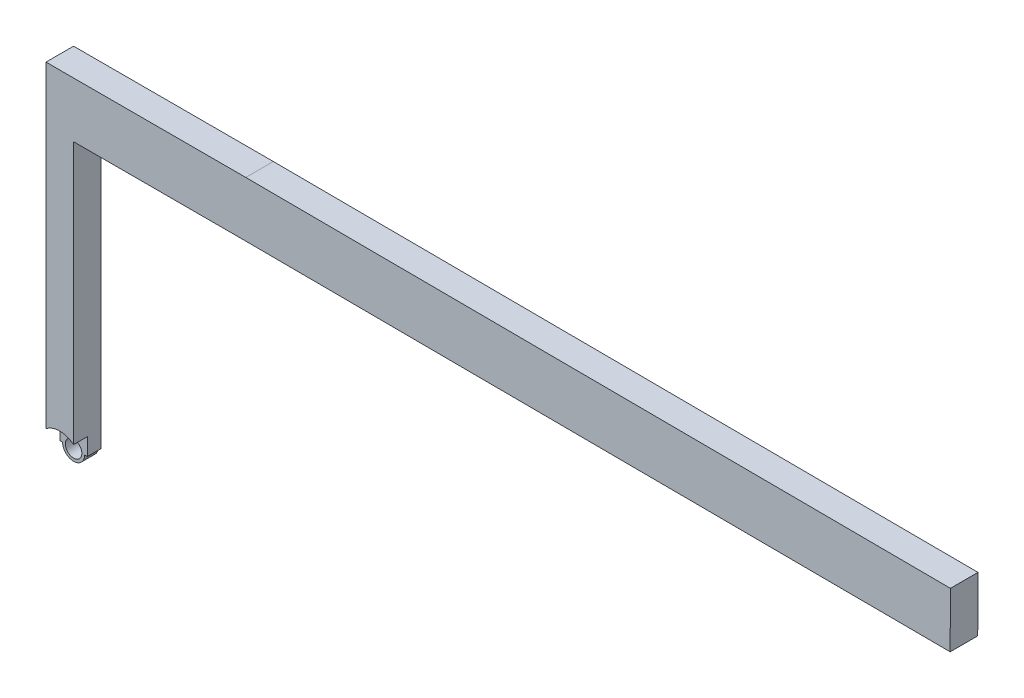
ISO-10303-21;
HEADER;
FILE_DESCRIPTION(('STEP AP214'),'2;1');
FILE_NAME('part.step','',(''),(''),'','','');
FILE_SCHEMA(('AUTOMOTIVE_DESIGN { 1 0 10303 214 1 1 1 1 }'));
ENDSEC;
DATA;
#1=APPLICATION_CONTEXT('core data for automotive mechanical design processes');
#2=APPLICATION_PROTOCOL_DEFINITION('international standard','automotive_design',2000,#1);
#3=PRODUCT_CONTEXT('',#1,'mechanical');
#4=PRODUCT('Part','Part','',(#3));
#5=PRODUCT_RELATED_PRODUCT_CATEGORY('part','',(#4));
#6=PRODUCT_DEFINITION_FORMATION('','',#4);
#7=PRODUCT_DEFINITION_CONTEXT('part definition',#1,'design');
#8=PRODUCT_DEFINITION('design','',#6,#7);
#9=PRODUCT_DEFINITION_SHAPE('','',#8);
#10=(LENGTH_UNIT() NAMED_UNIT(*) SI_UNIT(.MILLI.,.METRE.));
#11=(NAMED_UNIT(*) PLANE_ANGLE_UNIT() SI_UNIT($,.RADIAN.));
#12=(NAMED_UNIT(*) SI_UNIT($,.STERADIAN.) SOLID_ANGLE_UNIT());
#13=UNCERTAINTY_MEASURE_WITH_UNIT(LENGTH_MEASURE(1.E-05),#10,'distance_accuracy_value','');
#14=(GEOMETRIC_REPRESENTATION_CONTEXT(3) GLOBAL_UNCERTAINTY_ASSIGNED_CONTEXT((#13)) GLOBAL_UNIT_ASSIGNED_CONTEXT((#10,
#11,#12)) REPRESENTATION_CONTEXT('',''));
#15=CARTESIAN_POINT('',(0.,0.,0.));
#16=DIRECTION('',(0.,0.,1.));
#17=DIRECTION('',(1.,0.,0.));
#18=AXIS2_PLACEMENT_3D('',#15,#16,#17);
#19=CARTESIAN_POINT('',(24.1459547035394,13.3012355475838,1.27));
#20=DIRECTION('',(0.,0.,1.));
#21=DIRECTION('',(1.,0.,0.));
#22=AXIS2_PLACEMENT_3D('',#19,#20,#21);
#23=PLANE('',#22);
#24=CARTESIAN_POINT('',(-0.635,0.508,1.27));
#25=DIRECTION('',(0.,0.,1.));
#26=DIRECTION('',(1.,0.,0.));
#27=AXIS2_PLACEMENT_3D('',#24,#25,#26);
#28=CIRCLE('',#27,1.016);
#29=CARTESIAN_POINT('',(0.,1.3011147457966,1.27));
#30=VERTEX_POINT('',#29);
#31=CARTESIAN_POINT('',(-1.27,1.3011147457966,1.27));
#32=VERTEX_POINT('',#31);
#33=EDGE_CURVE('E148',#30,#32,#28,.T.);
#34=ORIENTED_EDGE('',*,*,#33,.F.);
#35=DIRECTION('',(0.,1.,0.));
#36=VECTOR('',#35,1.);
#37=CARTESIAN_POINT('',(0.,0.,1.27));
#38=LINE('',#37,#36);
#39=CARTESIAN_POINT('',(0.,13.382114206,1.27));
#40=VERTEX_POINT('',#39);
#41=EDGE_CURVE('E191',#30,#40,#38,.T.);
#42=ORIENTED_EDGE('',*,*,#41,.T.);
#43=DIRECTION('',(1.,0.,0.));
#44=VECTOR('',#43,1.);
#45=CARTESIAN_POINT('',(0.,13.382114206,1.27));
#46=LINE('',#45,#44);
#47=CARTESIAN_POINT('',(7.92442540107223,13.382114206,1.27));
#48=VERTEX_POINT('',#47);
#49=EDGE_CURVE('E193',#40,#48,#46,.T.);
#50=ORIENTED_EDGE('',*,*,#49,.T.);
#51=CARTESIAN_POINT('',(7.92442540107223,13.382114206,1.27));
#52=CARTESIAN_POINT('',(18.7387782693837,13.3281951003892,1.27));
#53=CARTESIAN_POINT('',(29.5531311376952,13.2742759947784,1.27));
#54=CARTESIAN_POINT('',(40.3674840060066,13.2203568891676,1.27));
#55=B_SPLINE_CURVE_WITH_KNOTS('',3,(#51,#52,#53,#54),.UNSPECIFIED.,.F.,.F.,(4,4),(0.,1.),.UNSPECIFIED.);
#56=CARTESIAN_POINT('',(40.3674840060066,13.2203568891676,1.27));
#57=VERTEX_POINT('',#56);
#58=EDGE_CURVE('E170',#48,#57,#55,.T.);
#59=ORIENTED_EDGE('',*,*,#58,.T.);
#60=DIRECTION('',(-0.00498582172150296,-0.999987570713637,0.));
#61=VECTOR('',#60,1.);
#62=CARTESIAN_POINT('',(40.3801479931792,15.7603253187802,1.27));
#63=LINE('',#62,#61);
#64=CARTESIAN_POINT('',(40.3801479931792,15.7603253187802,1.27));
#65=VERTEX_POINT('',#64);
#66=EDGE_CURVE('E174',#65,#57,#63,.T.);
#67=ORIENTED_EDGE('',*,*,#66,.F.);
#68=CARTESIAN_POINT('',(7.93075743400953,15.922114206,1.27));
#69=CARTESIAN_POINT('',(40.3801479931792,15.7603253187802,1.27));
#70=B_SPLINE_CURVE_WITH_KNOTS('',1,(#68,#69),.UNSPECIFIED.,.F.,.F.,(2,2),(0.,1.),.UNSPECIFIED.);
#71=CARTESIAN_POINT('',(7.93075743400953,15.922114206,1.27));
#72=VERTEX_POINT('',#71);
#73=EDGE_CURVE('E181',#72,#65,#70,.T.);
#74=ORIENTED_EDGE('',*,*,#73,.F.);
#75=DIRECTION('',(1.,0.,0.));
#76=VECTOR('',#75,1.);
#77=CARTESIAN_POINT('',(0.,15.922114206,1.27));
#78=LINE('',#77,#76);
#79=CARTESIAN_POINT('',(-1.27,15.922114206,1.27));
#80=VERTEX_POINT('',#79);
#81=EDGE_CURVE('E186',#80,#72,#78,.T.);
#82=ORIENTED_EDGE('',*,*,#81,.F.);
#83=DIRECTION('',(0.,-1.,0.));
#84=VECTOR('',#83,1.);
#85=CARTESIAN_POINT('',(-1.27,13.3012355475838,1.27));
#86=LINE('',#85,#84);
#87=EDGE_CURVE('E166',#80,#32,#86,.T.);
#88=ORIENTED_EDGE('',*,*,#87,.T.);
#89=EDGE_LOOP('',(#34,#42,#50,#59,#67,#74,#82,#88));
#90=FACE_BOUND('',#89,.T.);
#91=ADVANCED_FACE('F31',(#90),#23,.T.);
#92=CARTESIAN_POINT('',(0.,0.,1.27));
#93=DIRECTION('',(-1.,0.,0.));
#94=DIRECTION('',(0.,-1.,0.));
#95=AXIS2_PLACEMENT_3D('',#92,#93,#94);
#96=PLANE('',#95);
#97=DIRECTION('',(0.,1.,0.));
#98=VECTOR('',#97,1.);
#99=CARTESIAN_POINT('',(0.,0.,0.635));
#100=LINE('',#99,#98);
#101=CARTESIAN_POINT('',(0.,0.508,0.635));
#102=VERTEX_POINT('',#101);
#103=CARTESIAN_POINT('',(0.,1.3011147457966,0.635));
#104=VERTEX_POINT('',#103);
#105=EDGE_CURVE('E156',#102,#104,#100,.T.);
#106=ORIENTED_EDGE('',*,*,#105,.F.);
#107=DIRECTION('',(0.,0.,-1.));
#108=VECTOR('',#107,1.);
#109=CARTESIAN_POINT('',(0.,0.508,56.3948288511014));
#110=LINE('',#109,#108);
#111=CARTESIAN_POINT('',(0.,0.508,0.));
#112=VERTEX_POINT('',#111);
#113=EDGE_CURVE('E131',#102,#112,#110,.T.);
#114=ORIENTED_EDGE('',*,*,#113,.T.);
#115=DIRECTION('',(0.,1.,0.));
#116=VECTOR('',#115,1.);
#117=CARTESIAN_POINT('',(0.,0.,0.));
#118=LINE('',#117,#116);
#119=CARTESIAN_POINT('',(0.,13.382114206,0.));
#120=VERTEX_POINT('',#119);
#121=EDGE_CURVE('E216',#112,#120,#118,.T.);
#122=ORIENTED_EDGE('',*,*,#121,.T.);
#123=DIRECTION('',(0.,0.,-1.));
#124=VECTOR('',#123,1.);
#125=CARTESIAN_POINT('',(0.,13.382114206,1.27));
#126=LINE('',#125,#124);
#127=EDGE_CURVE('E221',#40,#120,#126,.T.);
#128=ORIENTED_EDGE('',*,*,#127,.F.);
#129=ORIENTED_EDGE('',*,*,#41,.F.);
#130=DIRECTION('',(0.,0.,1.));
#131=VECTOR('',#130,1.);
#132=CARTESIAN_POINT('',(0.,1.3011147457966,-2.23868195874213));
#133=LINE('',#132,#131);
#134=EDGE_CURVE('E153',#30,#104,#133,.F.);
#135=ORIENTED_EDGE('',*,*,#134,.T.);
#136=EDGE_LOOP('',(#106,#114,#122,#128,#129,#135));
#137=FACE_BOUND('',#136,.T.);
#138=ADVANCED_FACE('F246',(#137),#96,.F.);
#139=CARTESIAN_POINT('',(-1.27,0.,60.1023923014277));
#140=DIRECTION('',(-1.,0.,0.));
#141=DIRECTION('',(0.,0.,1.));
#142=AXIS2_PLACEMENT_3D('',#139,#140,#141);
#143=PLANE('',#142);
#144=DIRECTION('',(0.,0.,-1.));
#145=VECTOR('',#144,1.);
#146=CARTESIAN_POINT('',(-1.27,0.508,56.3948288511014));
#147=LINE('',#146,#145);
#148=CARTESIAN_POINT('',(-1.27,0.508,0.634999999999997));
#149=VERTEX_POINT('',#148);
#150=CARTESIAN_POINT('',(-1.27,0.508,0.));
#151=VERTEX_POINT('',#150);
#152=EDGE_CURVE('E139',#149,#151,#147,.T.);
#153=ORIENTED_EDGE('',*,*,#152,.F.);
#154=DIRECTION('',(0.,1.,0.));
#155=VECTOR('',#154,1.);
#156=CARTESIAN_POINT('',(-1.27,0.,0.634999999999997));
#157=LINE('',#156,#155);
#158=CARTESIAN_POINT('',(-1.27,1.3011147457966,0.635));
#159=VERTEX_POINT('',#158);
#160=EDGE_CURVE('E158',#149,#159,#157,.T.);
#161=ORIENTED_EDGE('',*,*,#160,.T.);
#162=DIRECTION('',(0.,0.,1.));
#163=VECTOR('',#162,1.);
#164=CARTESIAN_POINT('',(-1.27,1.3011147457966,-2.23868195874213));
#165=LINE('',#164,#163);
#166=EDGE_CURVE('E132',#32,#159,#165,.F.);
#167=ORIENTED_EDGE('',*,*,#166,.F.);
#168=ORIENTED_EDGE('',*,*,#87,.F.);
#169=DIRECTION('',(0.,0.,-1.));
#170=VECTOR('',#169,1.);
#171=CARTESIAN_POINT('',(-1.27,15.922114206,60.1023923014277));
#172=LINE('',#171,#170);
#173=CARTESIAN_POINT('',(-1.27,15.922114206,0.));
#174=VERTEX_POINT('',#173);
#175=EDGE_CURVE('E163',#80,#174,#172,.T.);
#176=ORIENTED_EDGE('',*,*,#175,.T.);
#177=DIRECTION('',(0.,-1.,0.));
#178=VECTOR('',#177,1.);
#179=CARTESIAN_POINT('',(-1.27,13.3012355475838,0.));
#180=LINE('',#179,#178);
#181=EDGE_CURVE('E231',#174,#151,#180,.T.);
#182=ORIENTED_EDGE('',*,*,#181,.T.);
#183=EDGE_LOOP('',(#153,#161,#167,#168,#176,#182));
#184=FACE_BOUND('',#183,.T.);
#185=ADVANCED_FACE('F253',(#184),#143,.T.);
#186=CARTESIAN_POINT('',(-0.635,0.508,0.));
#187=DIRECTION('',(0.,0.,1.));
#188=DIRECTION('',(1.,0.,0.));
#189=AXIS2_PLACEMENT_3D('',#186,#187,#188);
#190=CYLINDRICAL_SURFACE('',#189,0.381);
#191=CARTESIAN_POINT('',(-0.635,0.508,0.));
#192=DIRECTION('',(0.,0.,1.));
#193=DIRECTION('',(1.,0.,0.));
#194=AXIS2_PLACEMENT_3D('',#191,#192,#193);
#195=CIRCLE('',#194,0.381);
#196=CARTESIAN_POINT('',(-0.254,0.508,0.));
#197=VERTEX_POINT('',#196);
#198=EDGE_CURVE('E160',#197,#197,#195,.T.);
#199=ORIENTED_EDGE('',*,*,#198,.F.);
#200=EDGE_LOOP('',(#199));
#201=FACE_BOUND('',#200,.T.);
#202=CARTESIAN_POINT('',(-0.635,0.508,0.635));
#203=DIRECTION('',(0.,0.,1.));
#204=DIRECTION('',(1.,0.,0.));
#205=AXIS2_PLACEMENT_3D('',#202,#203,#204);
#206=CIRCLE('',#205,0.381);
#207=CARTESIAN_POINT('',(-0.254,0.508,0.635));
#208=VERTEX_POINT('',#207);
#209=EDGE_CURVE('E234',#208,#208,#206,.F.);
#210=ORIENTED_EDGE('',*,*,#209,.F.);
#211=EDGE_LOOP('',(#210));
#212=FACE_BOUND('',#211,.T.);
#213=ADVANCED_FACE('F289',(#201,#212),#190,.F.);
#214=CARTESIAN_POINT('',(0.,15.922114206,1.27));
#215=DIRECTION('',(0.,1.,0.));
#216=DIRECTION('',(0.,0.,1.));
#217=AXIS2_PLACEMENT_3D('',#214,#215,#216);
#218=PLANE('',#217);
#219=DIRECTION('',(1.,0.,0.));
#220=VECTOR('',#219,1.);
#221=CARTESIAN_POINT('',(0.,15.922114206,0.));
#222=LINE('',#221,#220);
#223=CARTESIAN_POINT('',(7.93075743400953,15.922114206,0.));
#224=VERTEX_POINT('',#223);
#225=EDGE_CURVE('E211',#174,#224,#222,.T.);
#226=ORIENTED_EDGE('',*,*,#225,.F.);
#227=ORIENTED_EDGE('',*,*,#175,.F.);
#228=ORIENTED_EDGE('',*,*,#81,.T.);
#229=DIRECTION('',(0.,0.,-1.));
#230=VECTOR('',#229,1.);
#231=CARTESIAN_POINT('',(7.93075743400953,15.922114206,1.27));
#232=LINE('',#231,#230);
#233=EDGE_CURVE('E224',#72,#224,#232,.T.);
#234=ORIENTED_EDGE('',*,*,#233,.T.);
#235=EDGE_LOOP('',(#226,#227,#228,#234));
#236=FACE_BOUND('',#235,.T.);
#237=ADVANCED_FACE('F256',(#236),#218,.T.);
#238=CARTESIAN_POINT('',(24.1459547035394,13.3012355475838,0.));
#239=DIRECTION('',(0.,0.,1.));
#240=DIRECTION('',(1.,0.,0.));
#241=AXIS2_PLACEMENT_3D('',#238,#239,#240);
#242=PLANE('',#241);
#243=ORIENTED_EDGE('',*,*,#198,.T.);
#244=EDGE_LOOP('',(#243));
#245=FACE_BOUND('',#244,.T.);
#246=CARTESIAN_POINT('',(-0.635,0.508,0.));
#247=DIRECTION('',(0.,0.,1.));
#248=DIRECTION('',(1.,0.,0.));
#249=AXIS2_PLACEMENT_3D('',#246,#247,#248);
#250=CIRCLE('',#249,0.508);
#251=CARTESIAN_POINT('',(-0.126999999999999,0.508,0.));
#252=VERTEX_POINT('',#251);
#253=CARTESIAN_POINT('',(-1.143,0.508,0.));
#254=VERTEX_POINT('',#253);
#255=EDGE_CURVE('E46',#252,#254,#250,.F.);
#256=ORIENTED_EDGE('',*,*,#255,.T.);
#257=DIRECTION('',(-1.,0.,0.));
#258=VECTOR('',#257,1.);
#259=CARTESIAN_POINT('',(24.1459547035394,0.508,0.));
#260=LINE('',#259,#258);
#261=EDGE_CURVE('E146',#254,#151,#260,.T.);
#262=ORIENTED_EDGE('',*,*,#261,.T.);
#263=ORIENTED_EDGE('',*,*,#181,.F.);
#264=ORIENTED_EDGE('',*,*,#225,.T.);
#265=CARTESIAN_POINT('',(7.93075743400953,15.922114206,0.));
#266=CARTESIAN_POINT('',(40.3801479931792,15.7603253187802,0.));
#267=B_SPLINE_CURVE_WITH_KNOTS('',1,(#265,#266),.UNSPECIFIED.,.F.,.F.,(2,2),(0.,1.),.UNSPECIFIED.);
#268=CARTESIAN_POINT('',(40.3801479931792,15.7603253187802,0.));
#269=VERTEX_POINT('',#268);
#270=EDGE_CURVE('E206',#224,#269,#267,.T.);
#271=ORIENTED_EDGE('',*,*,#270,.T.);
#272=DIRECTION('',(-0.00498582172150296,-0.999987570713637,0.));
#273=VECTOR('',#272,1.);
#274=CARTESIAN_POINT('',(40.3801479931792,15.7603253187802,0.));
#275=LINE('',#274,#273);
#276=CARTESIAN_POINT('',(40.3674840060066,13.2203568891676,0.));
#277=VERTEX_POINT('',#276);
#278=EDGE_CURVE('E200',#269,#277,#275,.T.);
#279=ORIENTED_EDGE('',*,*,#278,.T.);
#280=CARTESIAN_POINT('',(7.92442540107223,13.382114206,0.));
#281=CARTESIAN_POINT('',(18.7387782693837,13.3281951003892,0.));
#282=CARTESIAN_POINT('',(29.5531311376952,13.2742759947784,0.));
#283=CARTESIAN_POINT('',(40.3674840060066,13.2203568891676,0.));
#284=B_SPLINE_CURVE_WITH_KNOTS('',3,(#280,#281,#282,#283),.UNSPECIFIED.,.F.,.F.,(4,4),(0.,1.),.UNSPECIFIED.);
#285=CARTESIAN_POINT('',(7.92442540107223,13.382114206,0.));
#286=VERTEX_POINT('',#285);
#287=EDGE_CURVE('E169',#286,#277,#284,.T.);
#288=ORIENTED_EDGE('',*,*,#287,.F.);
#289=DIRECTION('',(1.,0.,0.));
#290=VECTOR('',#289,1.);
#291=CARTESIAN_POINT('',(0.,13.382114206,0.));
#292=LINE('',#291,#290);
#293=EDGE_CURVE('E175',#120,#286,#292,.T.);
#294=ORIENTED_EDGE('',*,*,#293,.F.);
#295=ORIENTED_EDGE('',*,*,#121,.F.);
#296=DIRECTION('',(-1.,0.,0.));
#297=VECTOR('',#296,1.);
#298=CARTESIAN_POINT('',(24.1459547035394,0.508,0.));
#299=LINE('',#298,#297);
#300=EDGE_CURVE('E142',#112,#252,#299,.T.);
#301=ORIENTED_EDGE('',*,*,#300,.T.);
#302=EDGE_LOOP('',(#256,#262,#263,#264,#271,#279,#288,#294,#295,#301));
#303=FACE_BOUND('',#302,.T.);
#304=ADVANCED_FACE('F259',(#245,#303),#242,.F.);
#305=CARTESIAN_POINT('',(7.92442540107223,13.382114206,1.27));
#306=DIRECTION('',(0.00498582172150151,0.999987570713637,0.));
#307=DIRECTION('',(-0.999987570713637,0.00498582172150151,0.));
#308=AXIS2_PLACEMENT_3D('',#305,#306,#307);
#309=PLANE('',#308);
#310=ORIENTED_EDGE('',*,*,#287,.T.);
#311=DIRECTION('',(0.,0.,-1.));
#312=VECTOR('',#311,1.);
#313=CARTESIAN_POINT('',(40.3674840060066,13.2203568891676,1.27));
#314=LINE('',#313,#312);
#315=EDGE_CURVE('E229',#57,#277,#314,.T.);
#316=ORIENTED_EDGE('',*,*,#315,.F.);
#317=ORIENTED_EDGE('',*,*,#58,.F.);
#318=DIRECTION('',(0.,0.,-1.));
#319=VECTOR('',#318,1.);
#320=CARTESIAN_POINT('',(7.92442540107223,13.382114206,1.27));
#321=LINE('',#320,#319);
#322=EDGE_CURVE('E195',#48,#286,#321,.T.);
#323=ORIENTED_EDGE('',*,*,#322,.T.);
#324=EDGE_LOOP('',(#310,#316,#317,#323));
#325=FACE_BOUND('',#324,.T.);
#326=ADVANCED_FACE('F33',(#325),#309,.F.);
#327=CARTESIAN_POINT('',(40.3801479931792,15.7603253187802,1.27));
#328=DIRECTION('',(0.999987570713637,-0.00498582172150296,0.));
#329=DIRECTION('',(0.00498582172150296,0.999987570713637,0.));
#330=AXIS2_PLACEMENT_3D('',#327,#328,#329);
#331=PLANE('',#330);
#332=ORIENTED_EDGE('',*,*,#278,.F.);
#333=DIRECTION('',(0.,0.,-1.));
#334=VECTOR('',#333,1.);
#335=CARTESIAN_POINT('',(40.3801479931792,15.7603253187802,1.27));
#336=LINE('',#335,#334);
#337=EDGE_CURVE('E227',#65,#269,#336,.T.);
#338=ORIENTED_EDGE('',*,*,#337,.F.);
#339=ORIENTED_EDGE('',*,*,#66,.T.);
#340=ORIENTED_EDGE('',*,*,#315,.T.);
#341=EDGE_LOOP('',(#332,#338,#339,#340));
#342=FACE_BOUND('',#341,.T.);
#343=ADVANCED_FACE('F291',(#342),#331,.T.);
#344=CARTESIAN_POINT('',(7.93075743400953,15.922114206,1.27));
#345=DIRECTION('',(0.00498582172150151,0.999987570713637,0.));
#346=DIRECTION('',(-0.999987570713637,0.00498582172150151,0.));
#347=AXIS2_PLACEMENT_3D('',#344,#345,#346);
#348=PLANE('',#347);
#349=ORIENTED_EDGE('',*,*,#270,.F.);
#350=ORIENTED_EDGE('',*,*,#233,.F.);
#351=ORIENTED_EDGE('',*,*,#73,.T.);
#352=ORIENTED_EDGE('',*,*,#337,.T.);
#353=EDGE_LOOP('',(#349,#350,#351,#352));
#354=FACE_BOUND('',#353,.T.);
#355=ADVANCED_FACE('F284',(#354),#348,.T.);
#356=CARTESIAN_POINT('',(0.,13.382114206,1.27));
#357=DIRECTION('',(0.,1.,0.));
#358=DIRECTION('',(0.,0.,1.));
#359=AXIS2_PLACEMENT_3D('',#356,#357,#358);
#360=PLANE('',#359);
#361=ORIENTED_EDGE('',*,*,#293,.T.);
#362=ORIENTED_EDGE('',*,*,#322,.F.);
#363=ORIENTED_EDGE('',*,*,#49,.F.);
#364=ORIENTED_EDGE('',*,*,#127,.T.);
#365=EDGE_LOOP('',(#361,#362,#363,#364));
#366=FACE_BOUND('',#365,.T.);
#367=ADVANCED_FACE('F282',(#366),#360,.F.);
#368=CARTESIAN_POINT('',(0.,0.,0.635));
#369=DIRECTION('',(0.,0.,1.));
#370=DIRECTION('',(1.,0.,0.));
#371=AXIS2_PLACEMENT_3D('',#368,#369,#370);
#372=PLANE('',#371);
#373=DIRECTION('',(-1.,0.,0.));
#374=VECTOR('',#373,1.);
#375=CARTESIAN_POINT('',(0.,0.508,0.635));
#376=LINE('',#375,#374);
#377=CARTESIAN_POINT('',(-1.143,0.508,0.634999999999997));
#378=VERTEX_POINT('',#377);
#379=EDGE_CURVE('E11',#378,#149,#376,.T.);
#380=ORIENTED_EDGE('',*,*,#379,.F.);
#381=CARTESIAN_POINT('',(-0.635,0.508,0.634999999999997));
#382=DIRECTION('',(0.,0.,1.));
#383=DIRECTION('',(1.,0.,0.));
#384=AXIS2_PLACEMENT_3D('',#381,#382,#383);
#385=CIRCLE('',#384,0.508);
#386=CARTESIAN_POINT('',(-0.127,0.508,0.634999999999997));
#387=VERTEX_POINT('',#386);
#388=EDGE_CURVE('E39',#387,#378,#385,.F.);
#389=ORIENTED_EDGE('',*,*,#388,.F.);
#390=DIRECTION('',(-1.,0.,0.));
#391=VECTOR('',#390,1.);
#392=CARTESIAN_POINT('',(0.,0.508,0.635));
#393=LINE('',#392,#391);
#394=EDGE_CURVE('E121',#102,#387,#393,.T.);
#395=ORIENTED_EDGE('',*,*,#394,.F.);
#396=ORIENTED_EDGE('',*,*,#105,.T.);
#397=CARTESIAN_POINT('',(-0.635,0.508,0.635));
#398=DIRECTION('',(0.,0.,1.));
#399=DIRECTION('',(1.,0.,0.));
#400=AXIS2_PLACEMENT_3D('',#397,#398,#399);
#401=CIRCLE('',#400,1.016);
#402=EDGE_CURVE('E150',#159,#104,#401,.F.);
#403=ORIENTED_EDGE('',*,*,#402,.F.);
#404=ORIENTED_EDGE('',*,*,#160,.F.);
#405=EDGE_LOOP('',(#380,#389,#395,#396,#403,#404));
#406=FACE_BOUND('',#405,.T.);
#407=ORIENTED_EDGE('',*,*,#209,.T.);
#408=EDGE_LOOP('',(#407));
#409=FACE_BOUND('',#408,.T.);
#410=ADVANCED_FACE('F119',(#406,#409),#372,.T.);
#411=CARTESIAN_POINT('',(-0.635,0.508,-2.23868195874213));
#412=DIRECTION('',(0.,0.,1.));
#413=DIRECTION('',(1.,0.,0.));
#414=AXIS2_PLACEMENT_3D('',#411,#412,#413);
#415=CYLINDRICAL_SURFACE('',#414,1.016);
#416=ORIENTED_EDGE('',*,*,#33,.T.);
#417=ORIENTED_EDGE('',*,*,#166,.T.);
#418=ORIENTED_EDGE('',*,*,#402,.T.);
#419=ORIENTED_EDGE('',*,*,#134,.F.);
#420=EDGE_LOOP('',(#416,#417,#418,#419));
#421=FACE_BOUND('',#420,.T.);
#422=ADVANCED_FACE('F241',(#421),#415,.F.);
#423=CARTESIAN_POINT('',(-1.143,0.508,56.3948288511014));
#424=DIRECTION('',(0.,1.,0.));
#425=DIRECTION('',(0.,0.,1.));
#426=AXIS2_PLACEMENT_3D('',#423,#424,#425);
#427=PLANE('',#426);
#428=ORIENTED_EDGE('',*,*,#261,.F.);
#429=DIRECTION('',(0.,0.,-1.));
#430=VECTOR('',#429,1.);
#431=CARTESIAN_POINT('',(-1.143,0.508,56.3948288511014));
#432=LINE('',#431,#430);
#433=EDGE_CURVE('E136',#378,#254,#432,.T.);
#434=ORIENTED_EDGE('',*,*,#433,.F.);
#435=ORIENTED_EDGE('',*,*,#379,.T.);
#436=ORIENTED_EDGE('',*,*,#152,.T.);
#437=EDGE_LOOP('',(#428,#434,#435,#436));
#438=FACE_BOUND('',#437,.T.);
#439=ADVANCED_FACE('F261',(#438),#427,.F.);
#440=CARTESIAN_POINT('',(-0.635,0.508,56.3948288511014));
#441=DIRECTION('',(0.,0.,-1.));
#442=DIRECTION('',(-1.,0.,0.));
#443=AXIS2_PLACEMENT_3D('',#440,#441,#442);
#444=CYLINDRICAL_SURFACE('',#443,0.508);
#445=ORIENTED_EDGE('',*,*,#255,.F.);
#446=DIRECTION('',(0.,0.,-1.));
#447=VECTOR('',#446,1.);
#448=CARTESIAN_POINT('',(-0.127,0.508,56.3948288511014));
#449=LINE('',#448,#447);
#450=EDGE_CURVE('E130',#387,#252,#449,.T.);
#451=ORIENTED_EDGE('',*,*,#450,.F.);
#452=ORIENTED_EDGE('',*,*,#388,.T.);
#453=ORIENTED_EDGE('',*,*,#433,.T.);
#454=EDGE_LOOP('',(#445,#451,#452,#453));
#455=FACE_BOUND('',#454,.T.);
#456=ADVANCED_FACE('F134',(#455),#444,.T.);
#457=CARTESIAN_POINT('',(-0.127,0.508,56.3948288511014));
#458=DIRECTION('',(0.,1.,0.));
#459=DIRECTION('',(0.,0.,1.));
#460=AXIS2_PLACEMENT_3D('',#457,#458,#459);
#461=PLANE('',#460);
#462=ORIENTED_EDGE('',*,*,#300,.F.);
#463=ORIENTED_EDGE('',*,*,#113,.F.);
#464=ORIENTED_EDGE('',*,*,#394,.T.);
#465=ORIENTED_EDGE('',*,*,#450,.T.);
#466=EDGE_LOOP('',(#462,#463,#464,#465));
#467=FACE_BOUND('',#466,.T.);
#468=ADVANCED_FACE('F129',(#467),#461,.F.);
#469=CLOSED_SHELL('',(#91,#138,#185,#213,#237,#304,#326,#343,#355,#367,#410,#422,#439,#456,#468));
#470=MANIFOLD_SOLID_BREP('B2',#469);
#471=ADVANCED_BREP_SHAPE_REPRESENTATION('',(#18,#470),#14);
#472=SHAPE_DEFINITION_REPRESENTATION(#9,#471);
ENDSEC;
END-ISO-10303-21;
